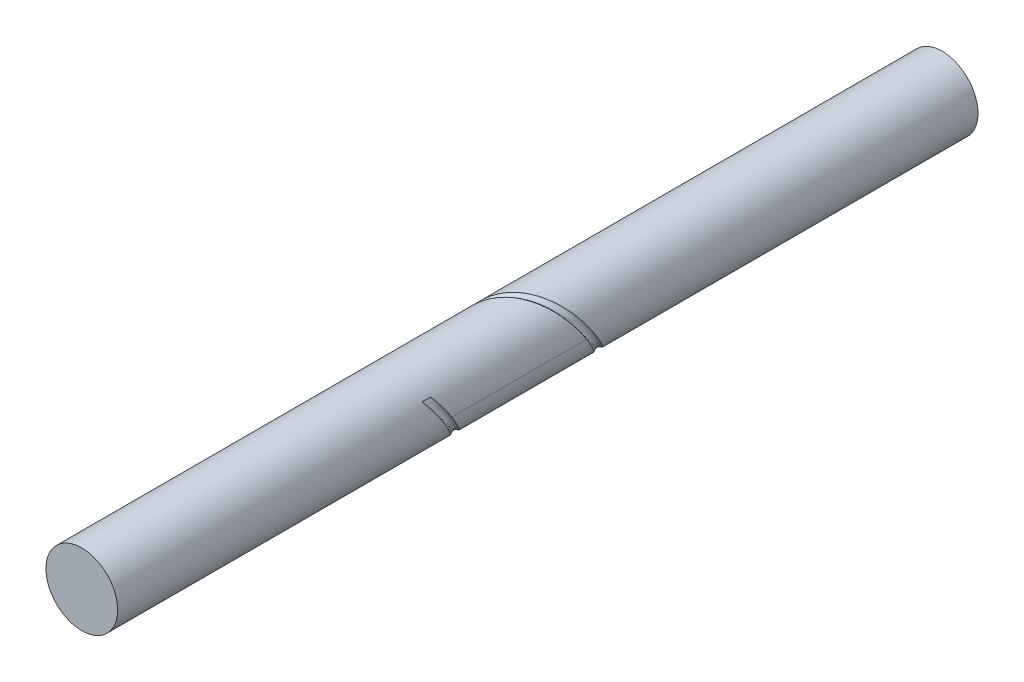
from build123d import *

# Parameters (mm, degrees)
SKETCH1_R              = 25
BOSS_EXTRUDE1_DEPTH    = 600
CUT_SWEEP1_PITCH       = 100
CUT_SWEEP1_HEIGHT      = 160
CUT_SWEEP1_RADIUS      = 27.646
CUT_SWEEP1_START_ANGLE = -180
SKETCH3_R              = 3.969


with BuildPart() as part:
    # Sketch1 → Boss-Extrude1 (new body)
    with BuildSketch(Plane.XY):
        Circle(SKETCH1_R)
    extrude(amount=BOSS_EXTRUDE1_DEPTH)

    # Cut-Sweep1: sweep along a helix
    with BuildLine() as cut_sweep1_path:
        add(Helix(CUT_SWEEP1_PITCH, CUT_SWEEP1_HEIGHT, CUT_SWEEP1_RADIUS, center=(0, 0, 220), direction=(0, 0, 1), mode=Mode.PRIVATE).rotate(Axis((0, 0, 220), (0, 0, 1)), CUT_SWEEP1_START_ANGLE))
    # Sketch3 → Cut-Sweep1 (sweep, cut)
    with BuildSketch(Plane(origin=(0, 0, 0), x_dir=(1, 0, 0), z_dir=(0, 1, 0))):
        with Locations((-27.646, -220)):
            Circle(SKETCH3_R)
    sweep(path=cut_sweep1_path.line, is_frenet=True, mode=Mode.SUBTRACT)


solid = part.part
